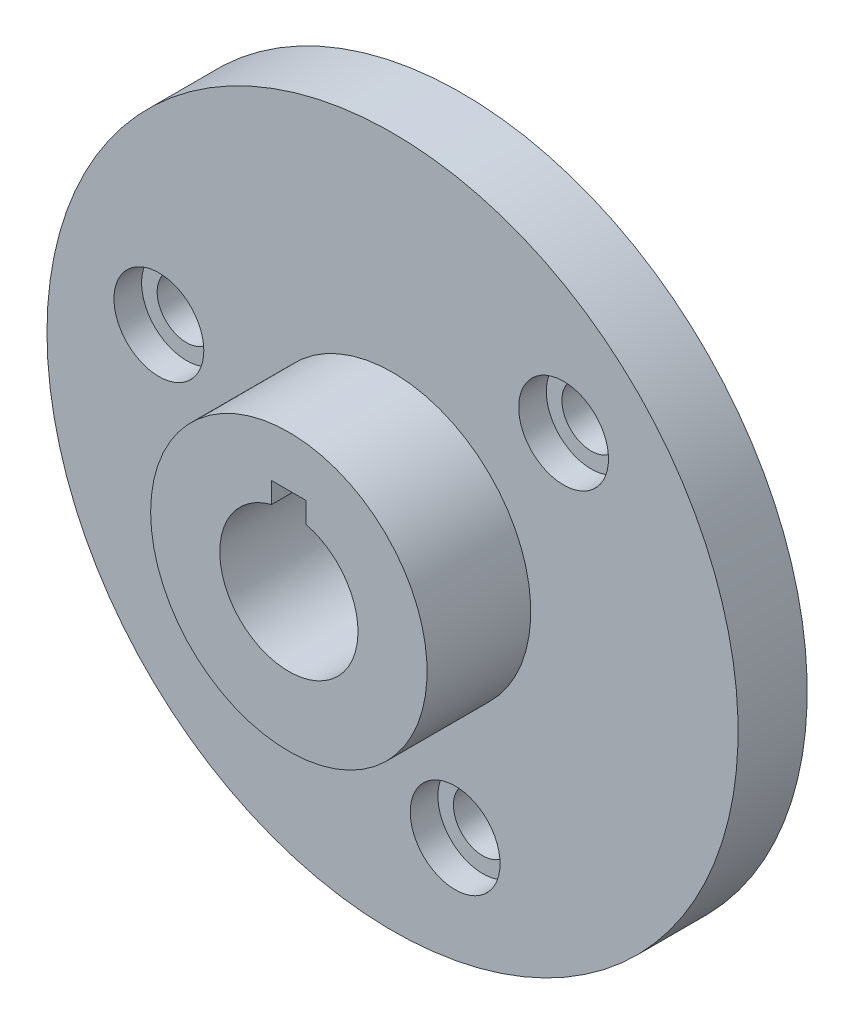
from build123d import *

# Parameters (mm, degrees)
SKETCH2_R                               = 10
CUT_EXTRUDE1_DEPTH                      = 76
CBORE_FOR_M8_HEX_HEAD_BOLT1_D           = 8.5
CBORE_FOR_M8_HEX_HEAD_BOLT1_CBORE_D     = 13
CBORE_FOR_M8_HEX_HEAD_BOLT1_CBORE_DEPTH = 4
CUT_EXTRUDE3_DEPTH                      = 76


with BuildPart() as part:
    # Sketch1 → Revolve1 (revolve)
    with BuildSketch(Plane.ZY, mode=Mode.PRIVATE) as revolve1_sk:
        Polygon((0, 0), (0, 20), (-15, 20), (-15, 50), (-25, 50), (-25, 0), align=None)
    revolve(revolve1_sk.sketch.rotate(Axis((0, 0, 0), (0, 0, 1)), 90), axis=Axis((0, 0, 0), (0, 0, 1)))

    # Sketch2 → Cut-Extrude1 (cut, through all)
    with BuildSketch(Plane.XY):
        Circle(SKETCH2_R)
    extrude(amount=-CUT_EXTRUDE1_DEPTH, mode=Mode.SUBTRACT)

    # CBORE for M8 Hex Head Bolt1 (through all)
    with Locations(Plane.XY.offset(-15)):
        with Locations((24.748737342, 24.748737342), (9.058666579, -33.80740392), (-33.80740392, 9.058666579)):
            CounterBoreHole(CBORE_FOR_M8_HEX_HEAD_BOLT1_D / 2, CBORE_FOR_M8_HEX_HEAD_BOLT1_CBORE_D / 2, CBORE_FOR_M8_HEX_HEAD_BOLT1_CBORE_DEPTH)

    # Sketch4 → Cut-Extrude3 (cut, through all)
    with BuildSketch(Plane.XY):
        with BuildLine():
            Line((2.5, 9.682458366), (2.5, 12.682458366))
            Line((2.5, 12.682458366), (-2.5, 12.682458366))
            Line((-2.5, 12.682458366), (-2.5, 9.682458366))
            ThreePointArc((-2.5, 9.682458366), (0, 10), (2.5, 9.682458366))
        make_face()
    extrude(amount=-CUT_EXTRUDE3_DEPTH, mode=Mode.SUBTRACT)


solid = part.part
